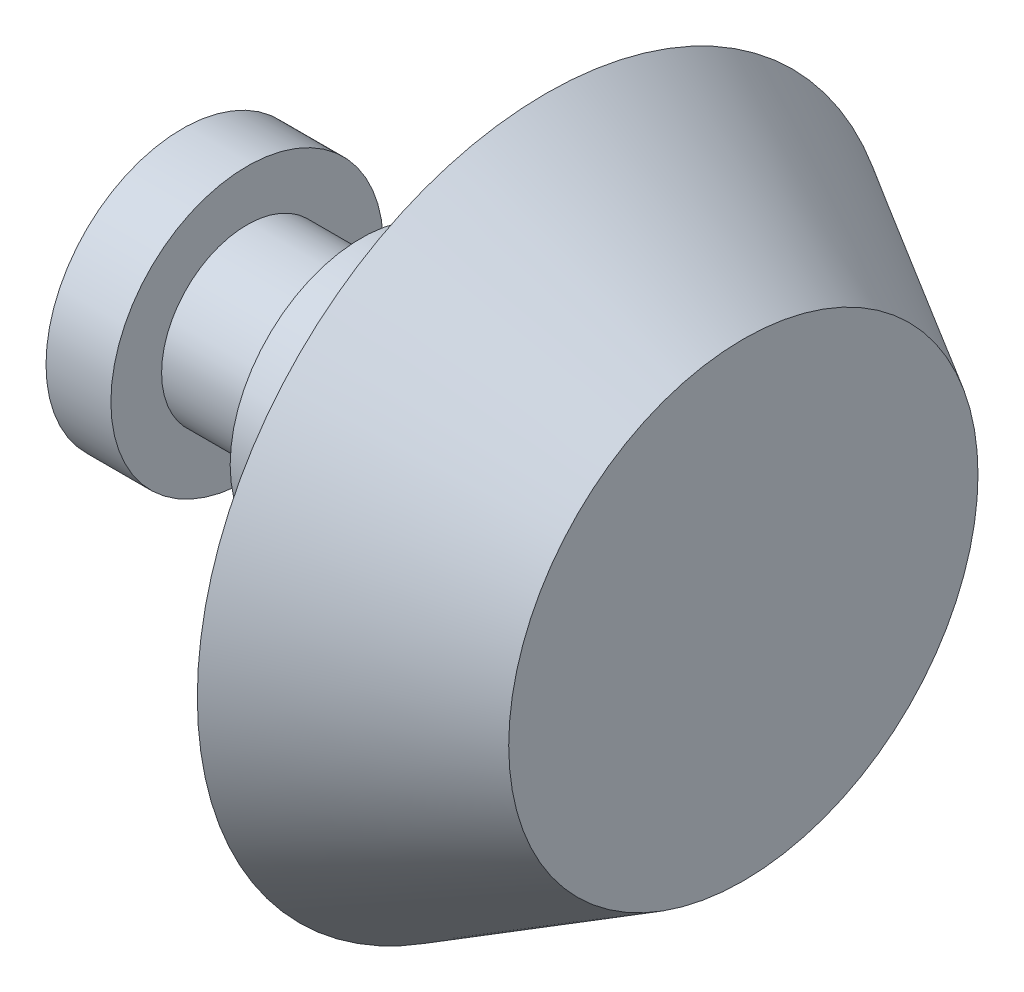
from build123d import *


with BuildPart() as part:
    # Esquisse1 → R_volution1 (revolve)
    with BuildSketch(Plane.XY, mode=Mode.PRIVATE) as r_volution1_sk:
        Polygon((120.580912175, 0), (120.580912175, 41.177257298), (85.939115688, 61.177707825), (85.939115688, 15), (62.257103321, 15), (62.257103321, 22.966789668), (53.493634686, 22.966789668), (53.493634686, 15), (33.493634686, 15), (33.493634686, 23.900369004), (22.107841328, 23.900369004), (22.107841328, 0), align=None)
    revolve(r_volution1_sk.sketch.rotate(Axis((0, 0, 0), (1, 0, 0)), 90), axis=Axis((0, 0, 0), (1, 0, 0)))


solid = part.part
